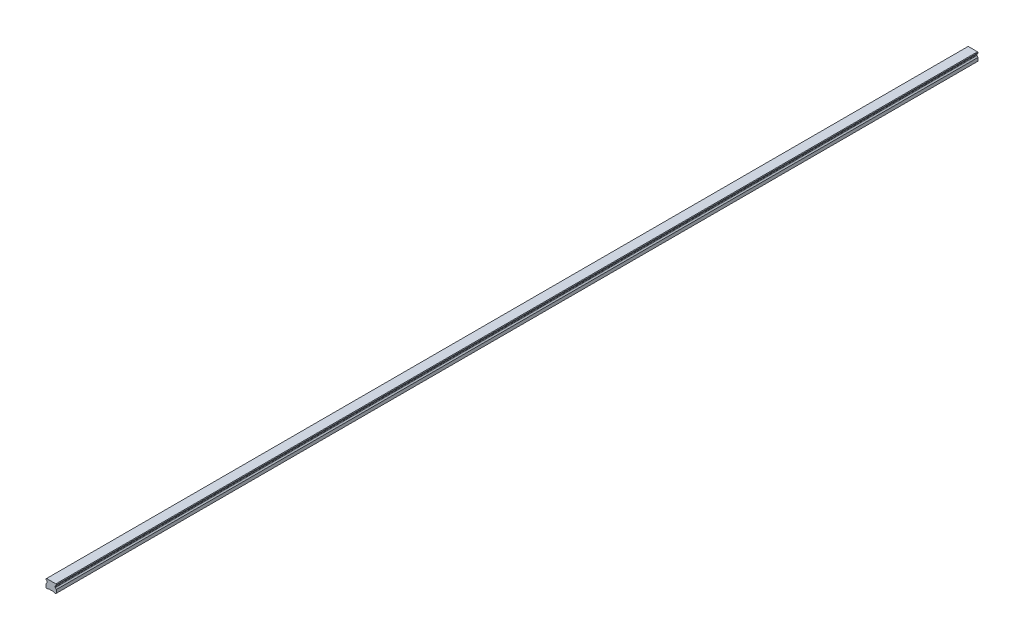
from build123d import *

# Parameters (mm, degrees)
SKETCH1_W           = 20
SKETCH1_H           = 16.3
BOSS_EXTRUDE1_DEPTH = 890
CUT_EXTRUDE1_DEPTH  = 1781.102718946
CHAMFER1_SIZE       = 1
FILLET1_R           = 1
CUT_EXTRUDE2_DEPTH  = 1781.102718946
SKETCH5_R           = 3
SKETCH5_R_2         = 2.5
CUT_EXTRUDE5_DEPTH  = 10
SKETCH5_2_R         = 2.5
CUT_EXTRUDE6_DEPTH  = 13
LPATTERN2_COUNT     = 30
LPATTERN2_PITCH     = 60


with BuildPart() as part:
    # Sketch1 → Boss-Extrude1 (new, symmetric)
    with BuildSketch(Plane.XY):
        with Locations((0, 8.15)):
            Rectangle(SKETCH1_W, SKETCH1_H)
    extrude(amount=BOSS_EXTRUDE1_DEPTH, both=True)

    # Sketch2 → Cut-Extrude1 (cut, through all)
    with BuildSketch(Plane.XY.offset(890)):
        Polygon((-10, 14.3), (-10, 7.3), (-7.666666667, 9.633333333), (-7.666666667, 11.966666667), align=None)
        Polygon((7.666666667, 11.966666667), (10, 14.3), (10, 7.3), (7.666666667, 9.633333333), align=None)
    extrude(amount=-CUT_EXTRUDE1_DEPTH, mode=Mode.SUBTRACT)

    # Chamfer1
    chamfer1_edges = [part.edges().sort_by_distance(p)[0] for p in [
        (-10, 16.3, 0),
        (10, 16.3, 0),
        (10, 0, 0),
        (-10, 0, 0),
    ]]
    chamfer(chamfer1_edges, length=CHAMFER1_SIZE)

    # Fillet1
    fillet1_edges = [part.edges().sort_by_distance(p)[0] for p in [
        (-7.666666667, 11.966666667, 0),
        (-7.666666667, 9.633333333, 0),
        (7.666666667, 9.633333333, 0),
        (7.666666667, 11.966666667, 0),
    ]]
    fillet(fillet1_edges, radius=FILLET1_R)

    # Sketch3 → Cut-Extrude2 (cut, through all)
    with BuildSketch(Plane.XY.offset(890)):
        Polygon((-6, 0), (-5, 1), (5, 1), (6, 0), align=None)
    extrude(amount=-CUT_EXTRUDE2_DEPTH, mode=Mode.SUBTRACT)

    # Sketch5 → Cut-Extrude5 (cut)
    with BuildSketch(Plane.XZ.offset(-1)):
        with Locations(Location((0, 870, 0), (0, 0, 270))):
            Circle(SKETCH5_R)
        with Locations(Location((0, 870, 0), (0, 0, 270))):
            Circle(SKETCH5_R_2, mode=Mode.SUBTRACT)
    cut_extrude5 = extrude(amount=-CUT_EXTRUDE5_DEPTH, mode=Mode.SUBTRACT)

    # Sketch5_2 → Cut-Extrude6 (cut)
    with BuildSketch(Plane.XZ.offset(-1)):
        with Locations(Location((0, 870, 0), (0, 0, 270))):
            Circle(SKETCH5_2_R)
    cut_extrude6 = extrude(amount=-CUT_EXTRUDE6_DEPTH, mode=Mode.SUBTRACT)

    # Cut-Extrude7 cone 1 section (on through the dimple's axis) → Cut-Extrude7 (revolve, cut)
    with BuildSketch(Plane(origin=(0, 14, 870), x_dir=(0, 0, -1), z_dir=(1, 0, 0))):
        Polygon((0, 0), (2.5, 0), (0, 1.443375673), align=None)
    cut_extrude7 = revolve(axis=Axis((0, 14, 870), (0, 1, 0)), mode=Mode.SUBTRACT)

    # LPattern2: Cut-Extrude5, Cut-Extrude6, Cut-Extrude7 ×30
    with Locations(*[(0, 0, -i * LPATTERN2_PITCH) for i in range(1, LPATTERN2_COUNT)]):
        add(cut_extrude5, mode=Mode.SUBTRACT)
        add(cut_extrude6, mode=Mode.SUBTRACT)
        add(cut_extrude7, mode=Mode.SUBTRACT)


solid = part.part
